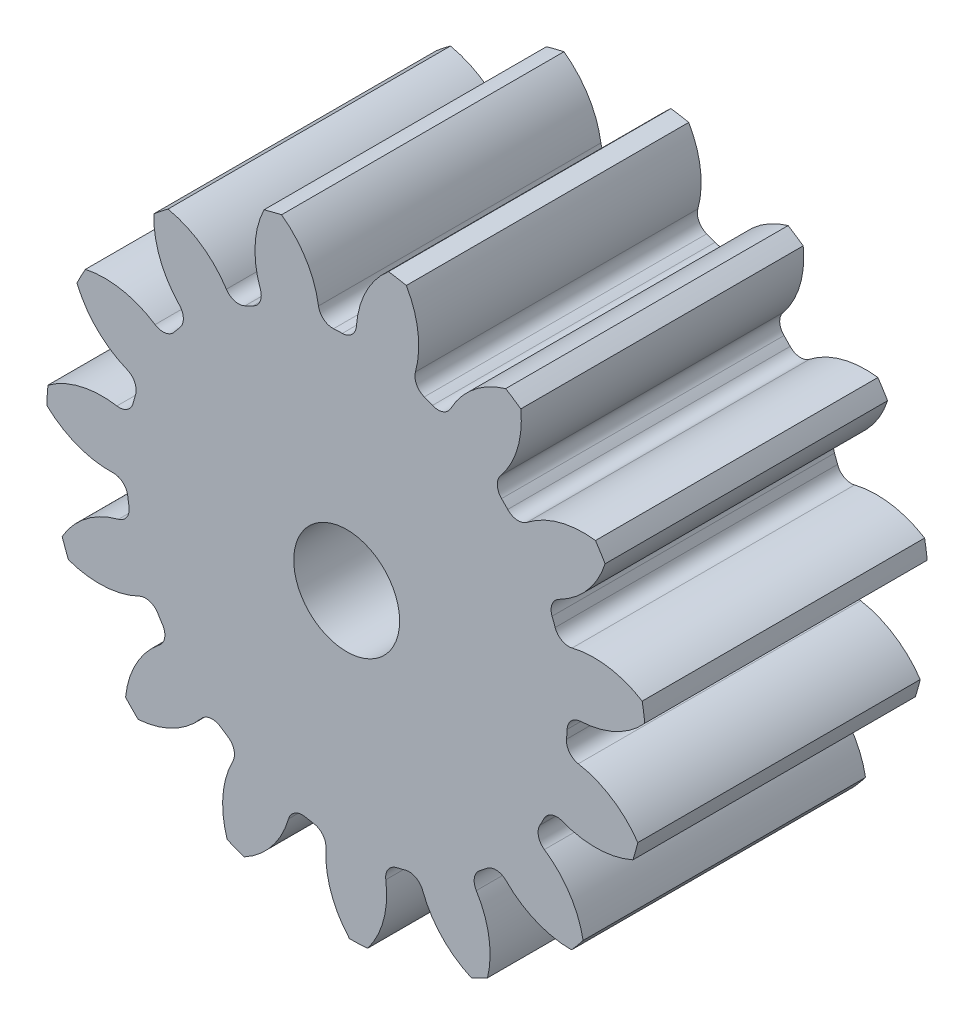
from build123d import *

# Parameters (mm, degrees)
SKETCH3_R         = 107.95
GEARBODY_DEPTH    = 101.6
TOOTHCUT_DEPTH    = 184.382019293
CIRPATTERN1_COUNT = 15
BOREDIA_R         = 19.05
BORE_DEPTH        = 12700


with BuildPart() as part:
    # Sketch3 → gearBody (new body)
    with BuildSketch(Plane.XY):
        Circle(SKETCH3_R)
    extrude(amount=GEARBODY_DEPTH)

    # Sketch2 → toothCut (cut, through all)
    with BuildSketch(Plane.XY):
        with BuildLine():
            ThreePointArc((79.087369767, -6.751190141), (79.206406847, -5.170661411), (79.293860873, -3.588070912))
            ThreePointArc((79.293860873, -3.588070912), (80.800496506, -0.168779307), (84.21812323, 1.341629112))
            ThreePointArc((84.21812323, 1.341629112), (97.317396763, 4.730228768), (107.95, 13.098103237))
            ThreePointArc((107.95, 13.098103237), (108.510756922, -7.083674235), (105.330973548, -27.021266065))
            ThreePointArc((105.330973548, -27.021266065), (95.876497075, -17.342089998), (83.328941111, -12.279243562))
            ThreePointArc((83.328941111, -12.279243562), (80.136684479, -10.337336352), (79.087369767, -6.751190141))
        make_face()
    toothcut = extrude(amount=TOOTHCUT_DEPTH, mode=Mode.SUBTRACT)

    # CirPattern1: toothCut ×15 about axis
    cirpattern1_axis = Axis((0, 0, 0), (0, 0, 1))
    for i in range(1, CIRPATTERN1_COUNT):
        add(toothcut.rotate(cirpattern1_axis, i * 360 / CIRPATTERN1_COUNT), mode=Mode.SUBTRACT)

    # boreDia → bore (cut, symmetric)
    with BuildSketch(Plane.XY):
        Circle(BOREDIA_R)
    extrude(amount=BORE_DEPTH, both=True, mode=Mode.SUBTRACT)


solid = part.part
